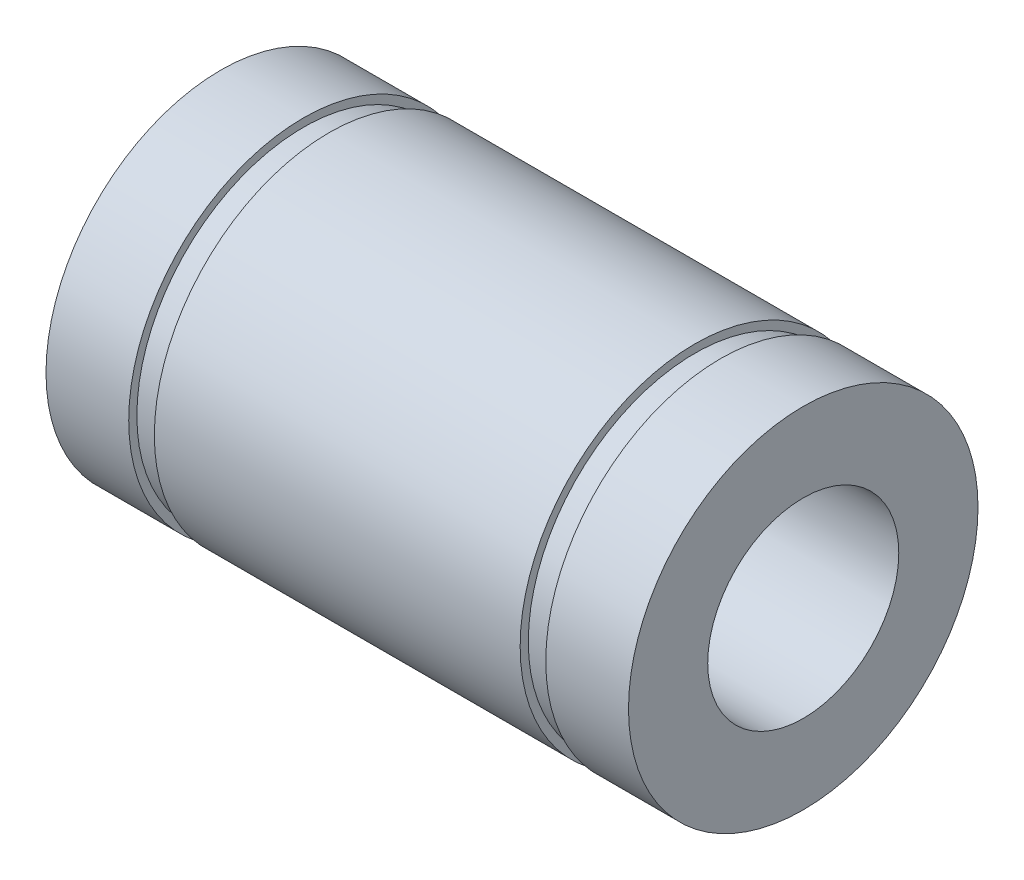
ISO-10303-21;
HEADER;
FILE_DESCRIPTION(('STEP AP214'),'2;1');
FILE_NAME('part.step','',(''),(''),'','','');
FILE_SCHEMA(('AUTOMOTIVE_DESIGN { 1 0 10303 214 1 1 1 1 }'));
ENDSEC;
DATA;
#1=APPLICATION_CONTEXT('core data for automotive mechanical design processes');
#2=APPLICATION_PROTOCOL_DEFINITION('international standard','automotive_design',2000,#1);
#3=PRODUCT_CONTEXT('',#1,'mechanical');
#4=PRODUCT('Part','Part','',(#3));
#5=PRODUCT_RELATED_PRODUCT_CATEGORY('part','',(#4));
#6=PRODUCT_DEFINITION_FORMATION('','',#4);
#7=PRODUCT_DEFINITION_CONTEXT('part definition',#1,'design');
#8=PRODUCT_DEFINITION('design','',#6,#7);
#9=PRODUCT_DEFINITION_SHAPE('','',#8);
#10=(LENGTH_UNIT() NAMED_UNIT(*) SI_UNIT(.MILLI.,.METRE.));
#11=(NAMED_UNIT(*) PLANE_ANGLE_UNIT() SI_UNIT($,.RADIAN.));
#12=(NAMED_UNIT(*) SI_UNIT($,.STERADIAN.) SOLID_ANGLE_UNIT());
#13=UNCERTAINTY_MEASURE_WITH_UNIT(LENGTH_MEASURE(1.E-05),#10,'distance_accuracy_value','');
#14=(GEOMETRIC_REPRESENTATION_CONTEXT(3) GLOBAL_UNCERTAINTY_ASSIGNED_CONTEXT((#13)) GLOBAL_UNIT_ASSIGNED_CONTEXT((#10,
#11,#12)) REPRESENTATION_CONTEXT('',''));
#15=CARTESIAN_POINT('',(0.,0.,0.));
#16=DIRECTION('',(0.,0.,1.));
#17=DIRECTION('',(1.,0.,0.));
#18=AXIS2_PLACEMENT_3D('',#15,#16,#17);
#19=CARTESIAN_POINT('',(10.7250000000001,-73.5000146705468,35.));
#20=DIRECTION('',(-1.,0.,0.));
#21=DIRECTION('',(0.,0.,1.));
#22=AXIS2_PLACEMENT_3D('',#19,#20,#21);
#23=CYLINDRICAL_SURFACE('',#22,7.5);
#24=CARTESIAN_POINT('',(8.94999998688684,-73.5000146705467,35.));
#25=DIRECTION('',(-1.,0.,0.));
#26=DIRECTION('',(0.,1.,0.));
#27=AXIS2_PLACEMENT_3D('',#24,#25,#26);
#28=CIRCLE('',#27,7.5);
#29=CARTESIAN_POINT('',(8.94999998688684,-66.0000146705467,35.));
#30=VERTEX_POINT('',#29);
#31=EDGE_CURVE('E29',#30,#30,#28,.T.);
#32=ORIENTED_EDGE('',*,*,#31,.F.);
#33=EDGE_LOOP('',(#32));
#34=FACE_BOUND('',#33,.T.);
#35=CARTESIAN_POINT('',(12.5000000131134,-73.5000146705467,35.));
#36=DIRECTION('',(-1.,0.,0.));
#37=DIRECTION('',(0.,0.,1.));
#38=AXIS2_PLACEMENT_3D('',#35,#36,#37);
#39=CIRCLE('',#38,7.5);
#40=CARTESIAN_POINT('',(12.5000000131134,-73.5000146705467,42.5));
#41=VERTEX_POINT('',#40);
#42=EDGE_CURVE('E8',#41,#41,#39,.T.);
#43=ORIENTED_EDGE('',*,*,#42,.T.);
#44=EDGE_LOOP('',(#43));
#45=FACE_BOUND('',#44,.T.);
#46=ADVANCED_FACE('F13',(#34,#45),#23,.T.);
#47=CARTESIAN_POINT('',(-1.31132060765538E-08,-73.5000146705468,35.));
#48=DIRECTION('',(-1.,0.,0.));
#49=DIRECTION('',(0.,0.,1.));
#50=AXIS2_PLACEMENT_3D('',#47,#48,#49);
#51=CYLINDRICAL_SURFACE('',#50,7.5);
#52=CARTESIAN_POINT('',(-7.85000001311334,-73.5000146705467,35.));
#53=DIRECTION('',(-1.,0.,0.));
#54=DIRECTION('',(0.,0.,1.));
#55=AXIS2_PLACEMENT_3D('',#52,#53,#54);
#56=CIRCLE('',#55,7.5);
#57=CARTESIAN_POINT('',(-7.85000001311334,-73.5000146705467,42.5));
#58=VERTEX_POINT('',#57);
#59=EDGE_CURVE('E30',#58,#58,#56,.T.);
#60=ORIENTED_EDGE('',*,*,#59,.F.);
#61=EDGE_LOOP('',(#60));
#62=FACE_BOUND('',#61,.T.);
#63=CARTESIAN_POINT('',(7.84999998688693,-73.5000146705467,35.));
#64=DIRECTION('',(1.,0.,0.));
#65=DIRECTION('',(0.,1.,0.));
#66=AXIS2_PLACEMENT_3D('',#63,#64,#65);
#67=CIRCLE('',#66,7.5);
#68=CARTESIAN_POINT('',(7.84999998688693,-66.0000146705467,35.));
#69=VERTEX_POINT('',#68);
#70=EDGE_CURVE('E35',#69,#69,#67,.T.);
#71=ORIENTED_EDGE('',*,*,#70,.F.);
#72=EDGE_LOOP('',(#71));
#73=FACE_BOUND('',#72,.T.);
#74=ADVANCED_FACE('F62',(#62,#73),#51,.T.);
#75=CARTESIAN_POINT('',(-7.85000001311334,-73.5000146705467,35.));
#76=DIRECTION('',(-1.,0.,0.));
#77=DIRECTION('',(0.,0.,1.));
#78=AXIS2_PLACEMENT_3D('',#75,#76,#77);
#79=CYLINDRICAL_SURFACE('',#78,7.15);
#80=CARTESIAN_POINT('',(-7.85000001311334,-73.5000146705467,35.));
#81=DIRECTION('',(1.,0.,0.));
#82=DIRECTION('',(0.,1.,0.));
#83=AXIS2_PLACEMENT_3D('',#80,#81,#82);
#84=CIRCLE('',#83,7.15);
#85=CARTESIAN_POINT('',(-7.85000001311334,-66.3500146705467,35.));
#86=VERTEX_POINT('',#85);
#87=EDGE_CURVE('E34',#86,#86,#84,.T.);
#88=ORIENTED_EDGE('',*,*,#87,.F.);
#89=EDGE_LOOP('',(#88));
#90=FACE_BOUND('',#89,.T.);
#91=CARTESIAN_POINT('',(-8.95000001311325,-73.5000146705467,35.));
#92=DIRECTION('',(-1.,0.,0.));
#93=DIRECTION('',(0.,0.,1.));
#94=AXIS2_PLACEMENT_3D('',#91,#92,#93);
#95=CIRCLE('',#94,7.15);
#96=CARTESIAN_POINT('',(-8.95000001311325,-73.5000146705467,42.15));
#97=VERTEX_POINT('',#96);
#98=EDGE_CURVE('E38',#97,#97,#95,.T.);
#99=ORIENTED_EDGE('',*,*,#98,.F.);
#100=EDGE_LOOP('',(#99));
#101=FACE_BOUND('',#100,.T.);
#102=ADVANCED_FACE('F68',(#90,#101),#79,.T.);
#103=CARTESIAN_POINT('',(8.39999998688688,-73.5000146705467,35.));
#104=DIRECTION('',(-1.,0.,0.));
#105=DIRECTION('',(0.,0.,1.));
#106=AXIS2_PLACEMENT_3D('',#103,#104,#105);
#107=CYLINDRICAL_SURFACE('',#106,7.15);
#108=CARTESIAN_POINT('',(7.84999998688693,-73.5000146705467,35.));
#109=DIRECTION('',(-1.,0.,0.));
#110=DIRECTION('',(0.,0.,1.));
#111=AXIS2_PLACEMENT_3D('',#108,#109,#110);
#112=CIRCLE('',#111,7.15);
#113=CARTESIAN_POINT('',(7.84999998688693,-73.5000146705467,42.15));
#114=VERTEX_POINT('',#113);
#115=EDGE_CURVE('E33',#114,#114,#112,.T.);
#116=ORIENTED_EDGE('',*,*,#115,.F.);
#117=EDGE_LOOP('',(#116));
#118=FACE_BOUND('',#117,.T.);
#119=CARTESIAN_POINT('',(8.94999998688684,-73.5000146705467,35.));
#120=DIRECTION('',(1.,0.,0.));
#121=DIRECTION('',(0.,1.,0.));
#122=AXIS2_PLACEMENT_3D('',#119,#120,#121);
#123=CIRCLE('',#122,7.15);
#124=CARTESIAN_POINT('',(8.94999998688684,-66.3500146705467,35.));
#125=VERTEX_POINT('',#124);
#126=EDGE_CURVE('E46',#125,#125,#123,.T.);
#127=ORIENTED_EDGE('',*,*,#126,.F.);
#128=EDGE_LOOP('',(#127));
#129=FACE_BOUND('',#128,.T.);
#130=ADVANCED_FACE('F15',(#118,#129),#107,.T.);
#131=CARTESIAN_POINT('',(-10.7249999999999,-73.5000146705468,35.));
#132=DIRECTION('',(-1.,0.,0.));
#133=DIRECTION('',(0.,0.,1.));
#134=AXIS2_PLACEMENT_3D('',#131,#132,#133);
#135=CYLINDRICAL_SURFACE('',#134,7.5);
#136=CARTESIAN_POINT('',(-12.4999999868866,-73.5000146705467,35.));
#137=DIRECTION('',(1.,0.,0.));
#138=DIRECTION('',(0.,1.,0.));
#139=AXIS2_PLACEMENT_3D('',#136,#137,#138);
#140=CIRCLE('',#139,7.5);
#141=CARTESIAN_POINT('',(-12.4999999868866,-66.0000146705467,35.));
#142=VERTEX_POINT('',#141);
#143=EDGE_CURVE('E21',#142,#142,#140,.T.);
#144=ORIENTED_EDGE('',*,*,#143,.T.);
#145=EDGE_LOOP('',(#144));
#146=FACE_BOUND('',#145,.T.);
#147=CARTESIAN_POINT('',(-8.95000001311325,-73.5000146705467,35.));
#148=DIRECTION('',(1.,0.,0.));
#149=DIRECTION('',(0.,0.,1.));
#150=AXIS2_PLACEMENT_3D('',#147,#148,#149);
#151=CIRCLE('',#150,7.5);
#152=CARTESIAN_POINT('',(-8.95000001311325,-73.5000146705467,42.5));
#153=VERTEX_POINT('',#152);
#154=EDGE_CURVE('E43',#153,#153,#151,.T.);
#155=ORIENTED_EDGE('',*,*,#154,.F.);
#156=EDGE_LOOP('',(#155));
#157=FACE_BOUND('',#156,.T.);
#158=ADVANCED_FACE('F77',(#146,#157),#135,.T.);
#159=CARTESIAN_POINT('',(12.5000000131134,-73.5000146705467,35.));
#160=DIRECTION('',(-1.,0.,0.));
#161=DIRECTION('',(0.,0.,1.));
#162=AXIS2_PLACEMENT_3D('',#159,#160,#161);
#163=CYLINDRICAL_SURFACE('',#162,4.1);
#164=CARTESIAN_POINT('',(12.5000000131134,-73.5000146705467,35.));
#165=DIRECTION('',(-1.,0.,0.));
#166=DIRECTION('',(0.,0.,1.));
#167=AXIS2_PLACEMENT_3D('',#164,#165,#166);
#168=CIRCLE('',#167,4.1);
#169=CARTESIAN_POINT('',(12.5000000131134,-73.5000146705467,39.1));
#170=VERTEX_POINT('',#169);
#171=EDGE_CURVE('E50',#170,#170,#168,.T.);
#172=ORIENTED_EDGE('',*,*,#171,.F.);
#173=EDGE_LOOP('',(#172));
#174=FACE_BOUND('',#173,.T.);
#175=CARTESIAN_POINT('',(-12.4999999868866,-73.5000146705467,35.));
#176=DIRECTION('',(-1.,0.,0.));
#177=DIRECTION('',(0.,0.,1.));
#178=AXIS2_PLACEMENT_3D('',#175,#176,#177);
#179=CIRCLE('',#178,4.1);
#180=CARTESIAN_POINT('',(-12.4999999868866,-73.5000146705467,39.1));
#181=VERTEX_POINT('',#180);
#182=EDGE_CURVE('E17',#181,#181,#179,.T.);
#183=ORIENTED_EDGE('',*,*,#182,.T.);
#184=EDGE_LOOP('',(#183));
#185=FACE_BOUND('',#184,.T.);
#186=ADVANCED_FACE('F73',(#174,#185),#163,.F.);
#187=CARTESIAN_POINT('',(12.5000000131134,-73.5000146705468,27.5));
#188=DIRECTION('',(-1.,0.,0.));
#189=DIRECTION('',(0.,-1.,0.));
#190=AXIS2_PLACEMENT_3D('',#187,#188,#189);
#191=PLANE('',#190);
#192=ORIENTED_EDGE('',*,*,#42,.F.);
#193=EDGE_LOOP('',(#192));
#194=FACE_BOUND('',#193,.T.);
#195=ORIENTED_EDGE('',*,*,#171,.T.);
#196=EDGE_LOOP('',(#195));
#197=FACE_BOUND('',#196,.T.);
#198=ADVANCED_FACE('F76',(#194,#197),#191,.F.);
#199=CARTESIAN_POINT('',(8.94999998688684,-73.5000146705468,27.5));
#200=DIRECTION('',(1.,0.,0.));
#201=DIRECTION('',(0.,1.,0.));
#202=AXIS2_PLACEMENT_3D('',#199,#200,#201);
#203=PLANE('',#202);
#204=ORIENTED_EDGE('',*,*,#31,.T.);
#205=EDGE_LOOP('',(#204));
#206=FACE_BOUND('',#205,.T.);
#207=ORIENTED_EDGE('',*,*,#126,.T.);
#208=EDGE_LOOP('',(#207));
#209=FACE_BOUND('',#208,.T.);
#210=ADVANCED_FACE('F58',(#206,#209),#203,.F.);
#211=CARTESIAN_POINT('',(-8.95000001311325,-73.5000146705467,35.));
#212=DIRECTION('',(-1.,0.,0.));
#213=DIRECTION('',(0.,0.,1.));
#214=AXIS2_PLACEMENT_3D('',#211,#212,#213);
#215=PLANE('',#214);
#216=ORIENTED_EDGE('',*,*,#154,.T.);
#217=EDGE_LOOP('',(#216));
#218=FACE_BOUND('',#217,.T.);
#219=ORIENTED_EDGE('',*,*,#98,.T.);
#220=EDGE_LOOP('',(#219));
#221=FACE_BOUND('',#220,.T.);
#222=ADVANCED_FACE('F89',(#218,#221),#215,.F.);
#223=CARTESIAN_POINT('',(7.84999998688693,-73.5000146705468,27.5));
#224=DIRECTION('',(1.,0.,0.));
#225=DIRECTION('',(0.,1.,0.));
#226=AXIS2_PLACEMENT_3D('',#223,#224,#225);
#227=PLANE('',#226);
#228=ORIENTED_EDGE('',*,*,#70,.T.);
#229=EDGE_LOOP('',(#228));
#230=FACE_BOUND('',#229,.T.);
#231=ORIENTED_EDGE('',*,*,#115,.T.);
#232=EDGE_LOOP('',(#231));
#233=FACE_BOUND('',#232,.T.);
#234=ADVANCED_FACE('F92',(#230,#233),#227,.T.);
#235=CARTESIAN_POINT('',(-7.85000001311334,-73.5000146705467,35.));
#236=DIRECTION('',(-1.,0.,0.));
#237=DIRECTION('',(0.,0.,1.));
#238=AXIS2_PLACEMENT_3D('',#235,#236,#237);
#239=PLANE('',#238);
#240=ORIENTED_EDGE('',*,*,#59,.T.);
#241=EDGE_LOOP('',(#240));
#242=FACE_BOUND('',#241,.T.);
#243=ORIENTED_EDGE('',*,*,#87,.T.);
#244=EDGE_LOOP('',(#243));
#245=FACE_BOUND('',#244,.T.);
#246=ADVANCED_FACE('F102',(#242,#245),#239,.T.);
#247=CARTESIAN_POINT('',(-12.4999999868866,-73.5000146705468,42.5));
#248=DIRECTION('',(1.,0.,0.));
#249=DIRECTION('',(0.,1.,0.));
#250=AXIS2_PLACEMENT_3D('',#247,#248,#249);
#251=PLANE('',#250);
#252=ORIENTED_EDGE('',*,*,#143,.F.);
#253=EDGE_LOOP('',(#252));
#254=FACE_BOUND('',#253,.T.);
#255=ORIENTED_EDGE('',*,*,#182,.F.);
#256=EDGE_LOOP('',(#255));
#257=FACE_BOUND('',#256,.T.);
#258=ADVANCED_FACE('F104',(#254,#257),#251,.F.);
#259=CLOSED_SHELL('',(#46,#74,#102,#130,#158,#186,#198,#210,#222,#234,#246,#258));
#260=MANIFOLD_SOLID_BREP('B1',#259);
#261=ADVANCED_BREP_SHAPE_REPRESENTATION('',(#18,#260),#14);
#262=SHAPE_DEFINITION_REPRESENTATION(#9,#261);
ENDSEC;
END-ISO-10303-21;
